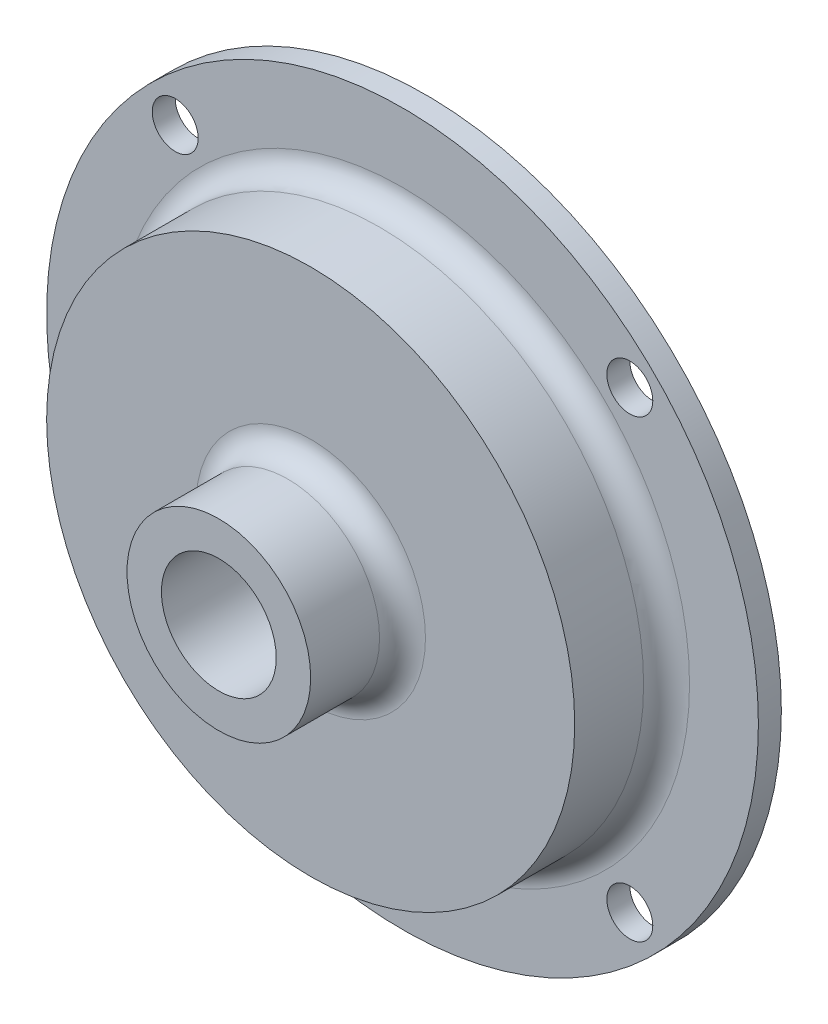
ISO-10303-21;
HEADER;
FILE_DESCRIPTION(('STEP AP214'),'2;1');
FILE_NAME('part.step','',(''),(''),'','','');
FILE_SCHEMA(('AUTOMOTIVE_DESIGN { 1 0 10303 214 1 1 1 1 }'));
ENDSEC;
DATA;
#1=APPLICATION_CONTEXT('core data for automotive mechanical design processes');
#2=APPLICATION_PROTOCOL_DEFINITION('international standard','automotive_design',2000,#1);
#3=PRODUCT_CONTEXT('',#1,'mechanical');
#4=PRODUCT('Part','Part','',(#3));
#5=PRODUCT_RELATED_PRODUCT_CATEGORY('part','',(#4));
#6=PRODUCT_DEFINITION_FORMATION('','',#4);
#7=PRODUCT_DEFINITION_CONTEXT('part definition',#1,'design');
#8=PRODUCT_DEFINITION('design','',#6,#7);
#9=PRODUCT_DEFINITION_SHAPE('','',#8);
#10=(LENGTH_UNIT() NAMED_UNIT(*) SI_UNIT(.MILLI.,.METRE.));
#11=(NAMED_UNIT(*) PLANE_ANGLE_UNIT() SI_UNIT($,.RADIAN.));
#12=(NAMED_UNIT(*) SI_UNIT($,.STERADIAN.) SOLID_ANGLE_UNIT());
#13=UNCERTAINTY_MEASURE_WITH_UNIT(LENGTH_MEASURE(1.E-05),#10,'distance_accuracy_value','');
#14=(GEOMETRIC_REPRESENTATION_CONTEXT(3) GLOBAL_UNCERTAINTY_ASSIGNED_CONTEXT((#13)) GLOBAL_UNIT_ASSIGNED_CONTEXT((#10,
#11,#12)) REPRESENTATION_CONTEXT('',''));
#15=CARTESIAN_POINT('',(0.,0.,0.));
#16=DIRECTION('',(0.,0.,1.));
#17=DIRECTION('',(1.,0.,0.));
#18=AXIS2_PLACEMENT_3D('',#15,#16,#17);
#19=CARTESIAN_POINT('',(0.,0.,15.875));
#20=DIRECTION('',(0.,0.,1.));
#21=DIRECTION('',(1.,0.,0.));
#22=AXIS2_PLACEMENT_3D('',#19,#20,#21);
#23=PLANE('',#22);
#24=CARTESIAN_POINT('',(0.,0.,15.875));
#25=DIRECTION('',(0.,0.,1.));
#26=DIRECTION('',(1.,0.,0.));
#27=AXIS2_PLACEMENT_3D('',#24,#25,#26);
#28=CIRCLE('',#27,15.875);
#29=CARTESIAN_POINT('',(15.875,0.,15.875));
#30=VERTEX_POINT('',#29);
#31=EDGE_CURVE('E37',#30,#30,#28,.F.);
#32=ORIENTED_EDGE('',*,*,#31,.T.);
#33=EDGE_LOOP('',(#32));
#34=FACE_BOUND('',#33,.T.);
#35=CARTESIAN_POINT('',(0.,0.,15.875));
#36=DIRECTION('',(0.,0.,1.));
#37=DIRECTION('',(1.,0.,0.));
#38=AXIS2_PLACEMENT_3D('',#35,#36,#37);
#39=CIRCLE('',#38,36.5125);
#40=CARTESIAN_POINT('',(36.5125,0.,15.875));
#41=VERTEX_POINT('',#40);
#42=EDGE_CURVE('E76',#41,#41,#39,.T.);
#43=ORIENTED_EDGE('',*,*,#42,.T.);
#44=EDGE_LOOP('',(#43));
#45=FACE_BOUND('',#44,.T.);
#46=ADVANCED_FACE('F26',(#34,#45),#23,.T.);
#47=CARTESIAN_POINT('',(0.,0.,3.175));
#48=DIRECTION('',(0.,0.,1.));
#49=DIRECTION('',(1.,0.,0.));
#50=AXIS2_PLACEMENT_3D('',#47,#48,#49);
#51=PLANE('',#50);
#52=CARTESIAN_POINT('',(0.,0.,3.175));
#53=DIRECTION('',(0.,0.,1.));
#54=DIRECTION('',(1.,0.,0.));
#55=AXIS2_PLACEMENT_3D('',#52,#53,#54);
#56=CIRCLE('',#55,39.6875);
#57=CARTESIAN_POINT('',(39.6875,0.,3.175));
#58=VERTEX_POINT('',#57);
#59=EDGE_CURVE('E10',#58,#58,#56,.F.);
#60=ORIENTED_EDGE('',*,*,#59,.T.);
#61=EDGE_LOOP('',(#60));
#62=FACE_BOUND('',#61,.T.);
#63=CARTESIAN_POINT('',(-31.4308964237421,31.430896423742,3.175));
#64=DIRECTION('',(0.,0.,1.));
#65=DIRECTION('',(1.,0.,0.));
#66=AXIS2_PLACEMENT_3D('',#63,#64,#65);
#67=CIRCLE('',#66,3.17500000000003);
#68=CARTESIAN_POINT('',(-28.2558964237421,31.430896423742,3.175));
#69=VERTEX_POINT('',#68);
#70=EDGE_CURVE('E70',#69,#69,#67,.T.);
#71=ORIENTED_EDGE('',*,*,#70,.F.);
#72=EDGE_LOOP('',(#71));
#73=FACE_BOUND('',#72,.T.);
#74=CARTESIAN_POINT('',(-31.430896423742,-31.4308964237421,3.175));
#75=DIRECTION('',(0.,0.,1.));
#76=DIRECTION('',(1.,0.,0.));
#77=AXIS2_PLACEMENT_3D('',#74,#75,#76);
#78=CIRCLE('',#77,3.17500000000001);
#79=CARTESIAN_POINT('',(-28.255896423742,-31.4308964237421,3.175));
#80=VERTEX_POINT('',#79);
#81=EDGE_CURVE('E58',#80,#80,#78,.T.);
#82=ORIENTED_EDGE('',*,*,#81,.F.);
#83=EDGE_LOOP('',(#82));
#84=FACE_BOUND('',#83,.T.);
#85=CARTESIAN_POINT('',(0.,0.,3.175));
#86=DIRECTION('',(0.,0.,1.));
#87=DIRECTION('',(1.,0.,0.));
#88=AXIS2_PLACEMENT_3D('',#85,#86,#87);
#89=CIRCLE('',#88,49.2125);
#90=CARTESIAN_POINT('',(49.2125,0.,3.175));
#91=VERTEX_POINT('',#90);
#92=EDGE_CURVE('E46',#91,#91,#89,.T.);
#93=ORIENTED_EDGE('',*,*,#92,.T.);
#94=EDGE_LOOP('',(#93));
#95=FACE_BOUND('',#94,.T.);
#96=CARTESIAN_POINT('',(31.430896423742,31.4308964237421,3.175));
#97=DIRECTION('',(0.,0.,1.));
#98=DIRECTION('',(1.,0.,0.));
#99=AXIS2_PLACEMENT_3D('',#96,#97,#98);
#100=CIRCLE('',#99,3.17500000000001);
#101=CARTESIAN_POINT('',(34.605896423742,31.4308964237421,3.175));
#102=VERTEX_POINT('',#101);
#103=EDGE_CURVE('E52',#102,#102,#100,.T.);
#104=ORIENTED_EDGE('',*,*,#103,.F.);
#105=EDGE_LOOP('',(#104));
#106=FACE_BOUND('',#105,.T.);
#107=CARTESIAN_POINT('',(31.4308964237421,-31.430896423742,3.175));
#108=DIRECTION('',(0.,0.,1.));
#109=DIRECTION('',(1.,0.,0.));
#110=AXIS2_PLACEMENT_3D('',#107,#108,#109);
#111=CIRCLE('',#110,3.17500000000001);
#112=CARTESIAN_POINT('',(34.6058964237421,-31.430896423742,3.175));
#113=VERTEX_POINT('',#112);
#114=EDGE_CURVE('E64',#113,#113,#111,.T.);
#115=ORIENTED_EDGE('',*,*,#114,.F.);
#116=EDGE_LOOP('',(#115));
#117=FACE_BOUND('',#116,.T.);
#118=ADVANCED_FACE('F111',(#62,#73,#84,#95,#106,#117),#51,.T.);
#119=CARTESIAN_POINT('',(0.,0.,0.));
#120=DIRECTION('',(0.,0.,1.));
#121=DIRECTION('',(1.,0.,0.));
#122=AXIS2_PLACEMENT_3D('',#119,#120,#121);
#123=PLANE('',#122);
#124=CARTESIAN_POINT('',(0.,0.,0.));
#125=DIRECTION('',(0.,0.,1.));
#126=DIRECTION('',(1.,0.,0.));
#127=AXIS2_PLACEMENT_3D('',#124,#125,#126);
#128=CIRCLE('',#127,7.9375);
#129=CARTESIAN_POINT('',(7.9375,0.,0.));
#130=VERTEX_POINT('',#129);
#131=EDGE_CURVE('E82',#130,#130,#128,.T.);
#132=ORIENTED_EDGE('',*,*,#131,.T.);
#133=EDGE_LOOP('',(#132));
#134=FACE_BOUND('',#133,.T.);
#135=CARTESIAN_POINT('',(31.4308964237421,-31.430896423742,0.));
#136=DIRECTION('',(0.,0.,1.));
#137=DIRECTION('',(1.,0.,0.));
#138=AXIS2_PLACEMENT_3D('',#135,#136,#137);
#139=CIRCLE('',#138,3.17500000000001);
#140=CARTESIAN_POINT('',(34.6058964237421,-31.430896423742,0.));
#141=VERTEX_POINT('',#140);
#142=EDGE_CURVE('E67',#141,#141,#139,.T.);
#143=ORIENTED_EDGE('',*,*,#142,.T.);
#144=EDGE_LOOP('',(#143));
#145=FACE_BOUND('',#144,.T.);
#146=CARTESIAN_POINT('',(31.430896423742,31.4308964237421,0.));
#147=DIRECTION('',(0.,0.,1.));
#148=DIRECTION('',(1.,0.,0.));
#149=AXIS2_PLACEMENT_3D('',#146,#147,#148);
#150=CIRCLE('',#149,3.17500000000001);
#151=CARTESIAN_POINT('',(34.605896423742,31.4308964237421,0.));
#152=VERTEX_POINT('',#151);
#153=EDGE_CURVE('E55',#152,#152,#150,.T.);
#154=ORIENTED_EDGE('',*,*,#153,.T.);
#155=EDGE_LOOP('',(#154));
#156=FACE_BOUND('',#155,.T.);
#157=CARTESIAN_POINT('',(0.,0.,0.));
#158=DIRECTION('',(0.,0.,1.));
#159=DIRECTION('',(1.,0.,0.));
#160=AXIS2_PLACEMENT_3D('',#157,#158,#159);
#161=CIRCLE('',#160,49.2125);
#162=CARTESIAN_POINT('',(49.2125,0.,0.));
#163=VERTEX_POINT('',#162);
#164=EDGE_CURVE('E49',#163,#163,#161,.T.);
#165=ORIENTED_EDGE('',*,*,#164,.F.);
#166=EDGE_LOOP('',(#165));
#167=FACE_BOUND('',#166,.T.);
#168=CARTESIAN_POINT('',(-31.430896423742,-31.4308964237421,0.));
#169=DIRECTION('',(0.,0.,1.));
#170=DIRECTION('',(1.,0.,0.));
#171=AXIS2_PLACEMENT_3D('',#168,#169,#170);
#172=CIRCLE('',#171,3.17500000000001);
#173=CARTESIAN_POINT('',(-28.255896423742,-31.4308964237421,0.));
#174=VERTEX_POINT('',#173);
#175=EDGE_CURVE('E61',#174,#174,#172,.T.);
#176=ORIENTED_EDGE('',*,*,#175,.T.);
#177=EDGE_LOOP('',(#176));
#178=FACE_BOUND('',#177,.T.);
#179=CARTESIAN_POINT('',(-31.4308964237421,31.430896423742,0.));
#180=DIRECTION('',(0.,0.,1.));
#181=DIRECTION('',(1.,0.,0.));
#182=AXIS2_PLACEMENT_3D('',#179,#180,#181);
#183=CIRCLE('',#182,3.17500000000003);
#184=CARTESIAN_POINT('',(-28.2558964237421,31.430896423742,0.));
#185=VERTEX_POINT('',#184);
#186=EDGE_CURVE('E73',#185,#185,#183,.T.);
#187=ORIENTED_EDGE('',*,*,#186,.T.);
#188=EDGE_LOOP('',(#187));
#189=FACE_BOUND('',#188,.T.);
#190=ADVANCED_FACE('F117',(#134,#145,#156,#167,#178,#189),#123,.F.);
#191=CARTESIAN_POINT('',(0.,0.,3.175));
#192=DIRECTION('',(0.,0.,-1.));
#193=DIRECTION('',(-1.,0.,0.));
#194=AXIS2_PLACEMENT_3D('',#191,#192,#193);
#195=CYLINDRICAL_SURFACE('',#194,49.2125);
#196=ORIENTED_EDGE('',*,*,#92,.F.);
#197=EDGE_LOOP('',(#196));
#198=FACE_BOUND('',#197,.T.);
#199=ORIENTED_EDGE('',*,*,#164,.T.);
#200=EDGE_LOOP('',(#199));
#201=FACE_BOUND('',#200,.T.);
#202=ADVANCED_FACE('F28',(#198,#201),#195,.T.);
#203=CARTESIAN_POINT('',(31.430896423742,31.4308964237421,3.175));
#204=DIRECTION('',(0.,0.,-1.));
#205=DIRECTION('',(-1.,0.,0.));
#206=AXIS2_PLACEMENT_3D('',#203,#204,#205);
#207=CYLINDRICAL_SURFACE('',#206,3.17500000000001);
#208=ORIENTED_EDGE('',*,*,#103,.T.);
#209=EDGE_LOOP('',(#208));
#210=FACE_BOUND('',#209,.T.);
#211=ORIENTED_EDGE('',*,*,#153,.F.);
#212=EDGE_LOOP('',(#211));
#213=FACE_BOUND('',#212,.T.);
#214=ADVANCED_FACE('F129',(#210,#213),#207,.F.);
#215=CARTESIAN_POINT('',(-31.430896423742,-31.4308964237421,3.175));
#216=DIRECTION('',(0.,0.,-1.));
#217=DIRECTION('',(-1.,0.,0.));
#218=AXIS2_PLACEMENT_3D('',#215,#216,#217);
#219=CYLINDRICAL_SURFACE('',#218,3.17500000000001);
#220=ORIENTED_EDGE('',*,*,#81,.T.);
#221=EDGE_LOOP('',(#220));
#222=FACE_BOUND('',#221,.T.);
#223=ORIENTED_EDGE('',*,*,#175,.F.);
#224=EDGE_LOOP('',(#223));
#225=FACE_BOUND('',#224,.T.);
#226=ADVANCED_FACE('F125',(#222,#225),#219,.F.);
#227=CARTESIAN_POINT('',(31.4308964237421,-31.430896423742,3.175));
#228=DIRECTION('',(0.,0.,-1.));
#229=DIRECTION('',(-1.,0.,0.));
#230=AXIS2_PLACEMENT_3D('',#227,#228,#229);
#231=CYLINDRICAL_SURFACE('',#230,3.17500000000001);
#232=ORIENTED_EDGE('',*,*,#114,.T.);
#233=EDGE_LOOP('',(#232));
#234=FACE_BOUND('',#233,.T.);
#235=ORIENTED_EDGE('',*,*,#142,.F.);
#236=EDGE_LOOP('',(#235));
#237=FACE_BOUND('',#236,.T.);
#238=ADVANCED_FACE('F121',(#234,#237),#231,.F.);
#239=CARTESIAN_POINT('',(-31.4308964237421,31.430896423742,3.175));
#240=DIRECTION('',(0.,0.,-1.));
#241=DIRECTION('',(-1.,0.,0.));
#242=AXIS2_PLACEMENT_3D('',#239,#240,#241);
#243=CYLINDRICAL_SURFACE('',#242,3.17500000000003);
#244=ORIENTED_EDGE('',*,*,#70,.T.);
#245=EDGE_LOOP('',(#244));
#246=FACE_BOUND('',#245,.T.);
#247=ORIENTED_EDGE('',*,*,#186,.F.);
#248=EDGE_LOOP('',(#247));
#249=FACE_BOUND('',#248,.T.);
#250=ADVANCED_FACE('F107',(#246,#249),#243,.F.);
#251=CARTESIAN_POINT('',(0.,0.,15.875));
#252=DIRECTION('',(0.,0.,-1.));
#253=DIRECTION('',(-1.,0.,0.));
#254=AXIS2_PLACEMENT_3D('',#251,#252,#253);
#255=CYLINDRICAL_SURFACE('',#254,36.5125);
#256=CARTESIAN_POINT('',(0.,0.,6.35));
#257=DIRECTION('',(0.,0.,1.));
#258=DIRECTION('',(1.,0.,0.));
#259=AXIS2_PLACEMENT_3D('',#256,#257,#258);
#260=CIRCLE('',#259,36.5125);
#261=CARTESIAN_POINT('',(36.5125,0.,6.35));
#262=VERTEX_POINT('',#261);
#263=EDGE_CURVE('E33',#262,#262,#260,.T.);
#264=ORIENTED_EDGE('',*,*,#263,.T.);
#265=EDGE_LOOP('',(#264));
#266=FACE_BOUND('',#265,.T.);
#267=ORIENTED_EDGE('',*,*,#42,.F.);
#268=EDGE_LOOP('',(#267));
#269=FACE_BOUND('',#268,.T.);
#270=ADVANCED_FACE('F100',(#266,#269),#255,.T.);
#271=CARTESIAN_POINT('',(0.,0.,28.575));
#272=DIRECTION('',(0.,0.,-1.));
#273=DIRECTION('',(-1.,0.,0.));
#274=AXIS2_PLACEMENT_3D('',#271,#272,#273);
#275=CYLINDRICAL_SURFACE('',#274,12.7);
#276=CARTESIAN_POINT('',(0.,0.,19.05));
#277=DIRECTION('',(0.,0.,1.));
#278=DIRECTION('',(1.,0.,0.));
#279=AXIS2_PLACEMENT_3D('',#276,#277,#278);
#280=CIRCLE('',#279,12.7);
#281=CARTESIAN_POINT('',(12.7,0.,19.05));
#282=VERTEX_POINT('',#281);
#283=EDGE_CURVE('E41',#282,#282,#280,.T.);
#284=ORIENTED_EDGE('',*,*,#283,.T.);
#285=EDGE_LOOP('',(#284));
#286=FACE_BOUND('',#285,.T.);
#287=CARTESIAN_POINT('',(0.,0.,28.575));
#288=DIRECTION('',(0.,0.,1.));
#289=DIRECTION('',(1.,0.,0.));
#290=AXIS2_PLACEMENT_3D('',#287,#288,#289);
#291=CIRCLE('',#290,12.7);
#292=CARTESIAN_POINT('',(12.7,0.,28.575));
#293=VERTEX_POINT('',#292);
#294=EDGE_CURVE('E79',#293,#293,#291,.T.);
#295=ORIENTED_EDGE('',*,*,#294,.F.);
#296=EDGE_LOOP('',(#295));
#297=FACE_BOUND('',#296,.T.);
#298=ADVANCED_FACE('F95',(#286,#297),#275,.T.);
#299=CARTESIAN_POINT('',(0.,0.,28.575));
#300=DIRECTION('',(0.,0.,1.));
#301=DIRECTION('',(1.,0.,0.));
#302=AXIS2_PLACEMENT_3D('',#299,#300,#301);
#303=PLANE('',#302);
#304=CARTESIAN_POINT('',(0.,0.,28.575));
#305=DIRECTION('',(0.,0.,1.));
#306=DIRECTION('',(1.,0.,0.));
#307=AXIS2_PLACEMENT_3D('',#304,#305,#306);
#308=CIRCLE('',#307,7.9375);
#309=CARTESIAN_POINT('',(7.9375,0.,28.575));
#310=VERTEX_POINT('',#309);
#311=EDGE_CURVE('E85',#310,#310,#308,.T.);
#312=ORIENTED_EDGE('',*,*,#311,.F.);
#313=EDGE_LOOP('',(#312));
#314=FACE_BOUND('',#313,.T.);
#315=ORIENTED_EDGE('',*,*,#294,.T.);
#316=EDGE_LOOP('',(#315));
#317=FACE_BOUND('',#316,.T.);
#318=ADVANCED_FACE('F91',(#314,#317),#303,.T.);
#319=CARTESIAN_POINT('',(0.,0.,19.05));
#320=DIRECTION('',(0.,0.,1.));
#321=DIRECTION('',(1.,0.,0.));
#322=AXIS2_PLACEMENT_3D('',#319,#320,#321);
#323=TOROIDAL_SURFACE('',#322,15.875,3.175);
#324=ORIENTED_EDGE('',*,*,#31,.F.);
#325=EDGE_LOOP('',(#324));
#326=FACE_BOUND('',#325,.T.);
#327=ORIENTED_EDGE('',*,*,#283,.F.);
#328=EDGE_LOOP('',(#327));
#329=FACE_BOUND('',#328,.T.);
#330=ADVANCED_FACE('F94',(#326,#329),#323,.F.);
#331=CARTESIAN_POINT('',(0.,0.,6.35));
#332=DIRECTION('',(0.,0.,1.));
#333=DIRECTION('',(1.,0.,0.));
#334=AXIS2_PLACEMENT_3D('',#331,#332,#333);
#335=TOROIDAL_SURFACE('',#334,39.6875,3.175);
#336=ORIENTED_EDGE('',*,*,#59,.F.);
#337=EDGE_LOOP('',(#336));
#338=FACE_BOUND('',#337,.T.);
#339=ORIENTED_EDGE('',*,*,#263,.F.);
#340=EDGE_LOOP('',(#339));
#341=FACE_BOUND('',#340,.T.);
#342=ADVANCED_FACE('F159',(#338,#341),#335,.F.);
#343=CARTESIAN_POINT('',(0.,0.,0.));
#344=DIRECTION('',(0.,0.,1.));
#345=DIRECTION('',(1.,0.,0.));
#346=AXIS2_PLACEMENT_3D('',#343,#344,#345);
#347=CYLINDRICAL_SURFACE('',#346,7.9375);
#348=ORIENTED_EDGE('',*,*,#131,.F.);
#349=EDGE_LOOP('',(#348));
#350=FACE_BOUND('',#349,.T.);
#351=ORIENTED_EDGE('',*,*,#311,.T.);
#352=EDGE_LOOP('',(#351));
#353=FACE_BOUND('',#352,.T.);
#354=ADVANCED_FACE('F89',(#350,#353),#347,.F.);
#355=CLOSED_SHELL('',(#46,#118,#190,#202,#214,#226,#238,#250,#270,#298,#318,#330,#342,#354));
#356=MANIFOLD_SOLID_BREP('B2',#355);
#357=ADVANCED_BREP_SHAPE_REPRESENTATION('',(#18,#356),#14);
#358=SHAPE_DEFINITION_REPRESENTATION(#9,#357);
ENDSEC;
END-ISO-10303-21;
